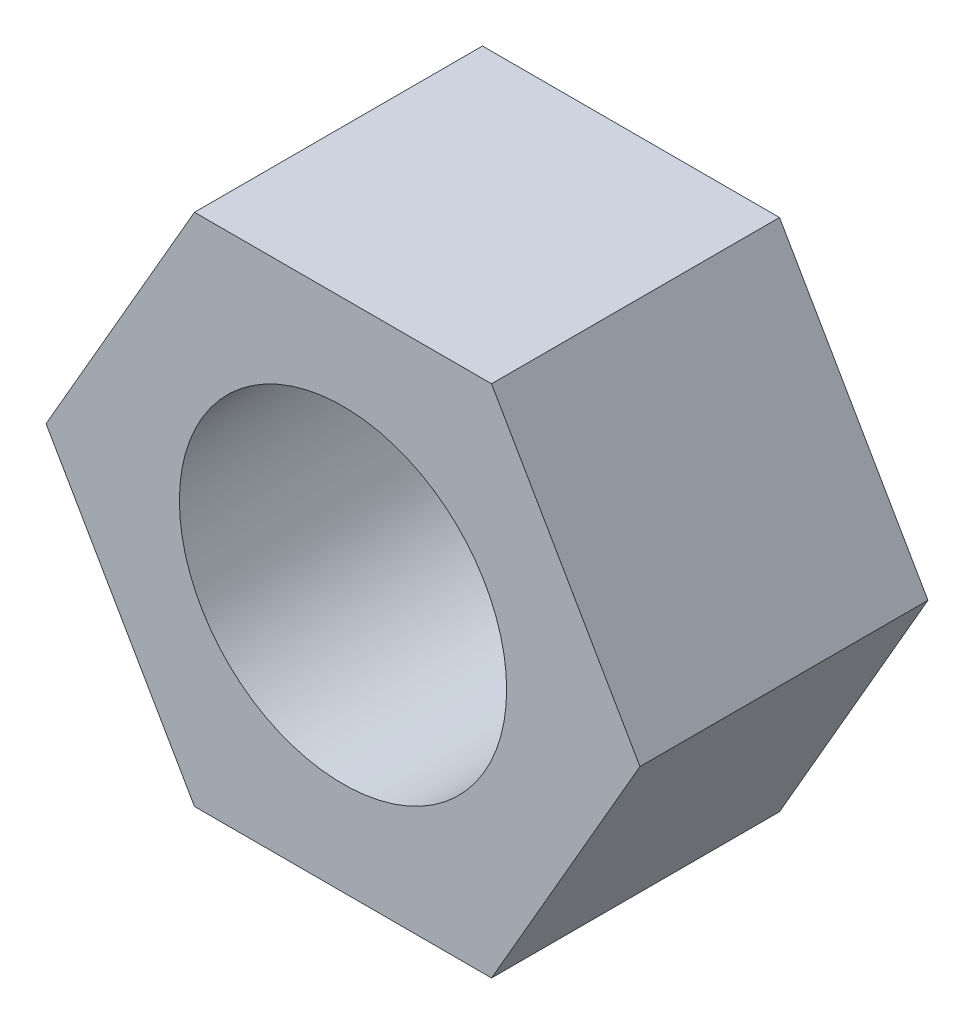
ISO-10303-21;
HEADER;
FILE_DESCRIPTION(('STEP AP214'),'2;1');
FILE_NAME('part.step','',(''),(''),'','','');
FILE_SCHEMA(('AUTOMOTIVE_DESIGN { 1 0 10303 214 1 1 1 1 }'));
ENDSEC;
DATA;
#1=APPLICATION_CONTEXT('core data for automotive mechanical design processes');
#2=APPLICATION_PROTOCOL_DEFINITION('international standard','automotive_design',2000,#1);
#3=PRODUCT_CONTEXT('',#1,'mechanical');
#4=PRODUCT('Part','Part','',(#3));
#5=PRODUCT_RELATED_PRODUCT_CATEGORY('part','',(#4));
#6=PRODUCT_DEFINITION_FORMATION('','',#4);
#7=PRODUCT_DEFINITION_CONTEXT('part definition',#1,'design');
#8=PRODUCT_DEFINITION('design','',#6,#7);
#9=PRODUCT_DEFINITION_SHAPE('','',#8);
#10=(LENGTH_UNIT() NAMED_UNIT(*) SI_UNIT(.MILLI.,.METRE.));
#11=(NAMED_UNIT(*) PLANE_ANGLE_UNIT() SI_UNIT($,.RADIAN.));
#12=(NAMED_UNIT(*) SI_UNIT($,.STERADIAN.) SOLID_ANGLE_UNIT());
#13=UNCERTAINTY_MEASURE_WITH_UNIT(LENGTH_MEASURE(1.E-05),#10,'distance_accuracy_value','');
#14=(GEOMETRIC_REPRESENTATION_CONTEXT(3) GLOBAL_UNCERTAINTY_ASSIGNED_CONTEXT((#13)) GLOBAL_UNIT_ASSIGNED_CONTEXT((#10,
#11,#12)) REPRESENTATION_CONTEXT('',''));
#15=CARTESIAN_POINT('',(0.,0.,0.));
#16=DIRECTION('',(0.,0.,1.));
#17=DIRECTION('',(1.,0.,0.));
#18=AXIS2_PLACEMENT_3D('',#15,#16,#17);
#19=CARTESIAN_POINT('',(5.04355371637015,-8.7376,9.779));
#20=DIRECTION('',(-0.866214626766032,0.499672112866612,0.));
#21=DIRECTION('',(-0.499672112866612,-0.866214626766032,0.));
#22=AXIS2_PLACEMENT_3D('',#19,#20,#21);
#23=PLANE('',#22);
#24=DIRECTION('',(0.499672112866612,0.866214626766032,0.));
#25=VECTOR('',#24,1.);
#26=CARTESIAN_POINT('',(5.04355371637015,-8.7376,0.));
#27=LINE('',#26,#25);
#28=CARTESIAN_POINT('',(5.04355371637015,-8.7376,0.));
#29=VERTEX_POINT('',#28);
#30=CARTESIAN_POINT('',(10.0838,0.,0.));
#31=VERTEX_POINT('',#30);
#32=EDGE_CURVE('E88',#29,#31,#27,.T.);
#33=ORIENTED_EDGE('',*,*,#32,.T.);
#34=DIRECTION('',(0.,0.,-1.));
#35=VECTOR('',#34,1.);
#36=CARTESIAN_POINT('',(10.0838,0.,9.779));
#37=LINE('',#36,#35);
#38=CARTESIAN_POINT('',(10.0838,0.,9.779));
#39=VERTEX_POINT('',#38);
#40=EDGE_CURVE('E11',#39,#31,#37,.T.);
#41=ORIENTED_EDGE('',*,*,#40,.F.);
#42=DIRECTION('',(0.499672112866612,0.866214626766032,0.));
#43=VECTOR('',#42,1.);
#44=CARTESIAN_POINT('',(5.04355371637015,-8.7376,9.779));
#45=LINE('',#44,#43);
#46=CARTESIAN_POINT('',(5.04355371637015,-8.7376,9.779));
#47=VERTEX_POINT('',#46);
#48=EDGE_CURVE('E116',#47,#39,#45,.T.);
#49=ORIENTED_EDGE('',*,*,#48,.F.);
#50=DIRECTION('',(0.,0.,-1.));
#51=VECTOR('',#50,1.);
#52=CARTESIAN_POINT('',(5.04355371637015,-8.7376,9.779));
#53=LINE('',#52,#51);
#54=EDGE_CURVE('E101',#47,#29,#53,.T.);
#55=ORIENTED_EDGE('',*,*,#54,.T.);
#56=EDGE_LOOP('',(#33,#41,#49,#55));
#57=FACE_BOUND('',#56,.T.);
#58=ADVANCED_FACE('F32',(#57),#23,.F.);
#59=CARTESIAN_POINT('',(5.04355371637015,8.7376,9.779));
#60=DIRECTION('',(-0.866214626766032,-0.499672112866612,0.));
#61=DIRECTION('',(0.499672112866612,-0.866214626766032,0.));
#62=AXIS2_PLACEMENT_3D('',#59,#60,#61);
#63=PLANE('',#62);
#64=DIRECTION('',(-0.499672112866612,0.866214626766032,0.));
#65=VECTOR('',#64,1.);
#66=CARTESIAN_POINT('',(5.04355371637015,8.7376,0.));
#67=LINE('',#66,#65);
#68=CARTESIAN_POINT('',(5.04355371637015,8.7376,0.));
#69=VERTEX_POINT('',#68);
#70=EDGE_CURVE('E84',#31,#69,#67,.T.);
#71=ORIENTED_EDGE('',*,*,#70,.T.);
#72=DIRECTION('',(0.,0.,-1.));
#73=VECTOR('',#72,1.);
#74=CARTESIAN_POINT('',(5.04355371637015,8.7376,9.779));
#75=LINE('',#74,#73);
#76=CARTESIAN_POINT('',(5.04355371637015,8.7376,9.779));
#77=VERTEX_POINT('',#76);
#78=EDGE_CURVE('E39',#77,#69,#75,.T.);
#79=ORIENTED_EDGE('',*,*,#78,.F.);
#80=DIRECTION('',(-0.499672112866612,0.866214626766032,0.));
#81=VECTOR('',#80,1.);
#82=CARTESIAN_POINT('',(5.04355371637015,8.7376,9.779));
#83=LINE('',#82,#81);
#84=EDGE_CURVE('E97',#39,#77,#83,.T.);
#85=ORIENTED_EDGE('',*,*,#84,.F.);
#86=ORIENTED_EDGE('',*,*,#40,.T.);
#87=EDGE_LOOP('',(#71,#79,#85,#86));
#88=FACE_BOUND('',#87,.T.);
#89=ADVANCED_FACE('F96',(#88),#63,.F.);
#90=CARTESIAN_POINT('',(5.04355371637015,8.7376,9.779));
#91=DIRECTION('',(0.,-1.,0.));
#92=DIRECTION('',(0.,0.,-1.));
#93=AXIS2_PLACEMENT_3D('',#90,#91,#92);
#94=PLANE('',#93);
#95=DIRECTION('',(-1.,0.,0.));
#96=VECTOR('',#95,1.);
#97=CARTESIAN_POINT('',(5.04355371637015,8.7376,0.));
#98=LINE('',#97,#96);
#99=CARTESIAN_POINT('',(-5.04355371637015,8.7376,0.));
#100=VERTEX_POINT('',#99);
#101=EDGE_CURVE('E90',#69,#100,#98,.T.);
#102=ORIENTED_EDGE('',*,*,#101,.T.);
#103=DIRECTION('',(0.,0.,-1.));
#104=VECTOR('',#103,1.);
#105=CARTESIAN_POINT('',(-5.04355371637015,8.7376,9.779));
#106=LINE('',#105,#104);
#107=CARTESIAN_POINT('',(-5.04355371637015,8.7376,9.779));
#108=VERTEX_POINT('',#107);
#109=EDGE_CURVE('E132',#108,#100,#106,.T.);
#110=ORIENTED_EDGE('',*,*,#109,.F.);
#111=DIRECTION('',(-1.,0.,0.));
#112=VECTOR('',#111,1.);
#113=CARTESIAN_POINT('',(5.04355371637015,8.7376,9.779));
#114=LINE('',#113,#112);
#115=EDGE_CURVE('E119',#77,#108,#114,.T.);
#116=ORIENTED_EDGE('',*,*,#115,.F.);
#117=ORIENTED_EDGE('',*,*,#78,.T.);
#118=EDGE_LOOP('',(#102,#110,#116,#117));
#119=FACE_BOUND('',#118,.T.);
#120=ADVANCED_FACE('F136',(#119),#94,.F.);
#121=CARTESIAN_POINT('',(-5.04355371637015,8.7376,9.779));
#122=DIRECTION('',(0.866214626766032,-0.499672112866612,0.));
#123=DIRECTION('',(0.499672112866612,0.866214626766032,0.));
#124=AXIS2_PLACEMENT_3D('',#121,#122,#123);
#125=PLANE('',#124);
#126=DIRECTION('',(-0.499672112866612,-0.866214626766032,0.));
#127=VECTOR('',#126,1.);
#128=CARTESIAN_POINT('',(-5.04355371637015,8.7376,0.));
#129=LINE('',#128,#127);
#130=CARTESIAN_POINT('',(-10.0838,0.,0.));
#131=VERTEX_POINT('',#130);
#132=EDGE_CURVE('E110',#100,#131,#129,.T.);
#133=ORIENTED_EDGE('',*,*,#132,.T.);
#134=DIRECTION('',(0.,0.,-1.));
#135=VECTOR('',#134,1.);
#136=CARTESIAN_POINT('',(-10.0838,0.,9.779));
#137=LINE('',#136,#135);
#138=CARTESIAN_POINT('',(-10.0838,0.,9.779));
#139=VERTEX_POINT('',#138);
#140=EDGE_CURVE('E129',#139,#131,#137,.T.);
#141=ORIENTED_EDGE('',*,*,#140,.F.);
#142=DIRECTION('',(-0.499672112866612,-0.866214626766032,0.));
#143=VECTOR('',#142,1.);
#144=CARTESIAN_POINT('',(-5.04355371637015,8.7376,9.779));
#145=LINE('',#144,#143);
#146=EDGE_CURVE('E121',#108,#139,#145,.T.);
#147=ORIENTED_EDGE('',*,*,#146,.F.);
#148=ORIENTED_EDGE('',*,*,#109,.T.);
#149=EDGE_LOOP('',(#133,#141,#147,#148));
#150=FACE_BOUND('',#149,.T.);
#151=ADVANCED_FACE('F142',(#150),#125,.F.);
#152=CARTESIAN_POINT('',(-5.04355371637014,-8.7376,9.779));
#153=DIRECTION('',(0.866214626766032,0.499672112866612,0.));
#154=DIRECTION('',(-0.499672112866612,0.866214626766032,0.));
#155=AXIS2_PLACEMENT_3D('',#152,#153,#154);
#156=PLANE('',#155);
#157=DIRECTION('',(0.499672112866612,-0.866214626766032,0.));
#158=VECTOR('',#157,1.);
#159=CARTESIAN_POINT('',(-5.04355371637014,-8.7376,0.));
#160=LINE('',#159,#158);
#161=CARTESIAN_POINT('',(-5.04355371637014,-8.7376,0.));
#162=VERTEX_POINT('',#161);
#163=EDGE_CURVE('E112',#131,#162,#160,.T.);
#164=ORIENTED_EDGE('',*,*,#163,.T.);
#165=DIRECTION('',(0.,0.,-1.));
#166=VECTOR('',#165,1.);
#167=CARTESIAN_POINT('',(-5.04355371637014,-8.7376,9.779));
#168=LINE('',#167,#166);
#169=CARTESIAN_POINT('',(-5.04355371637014,-8.7376,9.779));
#170=VERTEX_POINT('',#169);
#171=EDGE_CURVE('E126',#170,#162,#168,.T.);
#172=ORIENTED_EDGE('',*,*,#171,.F.);
#173=DIRECTION('',(0.499672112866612,-0.866214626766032,0.));
#174=VECTOR('',#173,1.);
#175=CARTESIAN_POINT('',(-5.04355371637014,-8.7376,9.779));
#176=LINE('',#175,#174);
#177=EDGE_CURVE('E51',#139,#170,#176,.T.);
#178=ORIENTED_EDGE('',*,*,#177,.F.);
#179=ORIENTED_EDGE('',*,*,#140,.T.);
#180=EDGE_LOOP('',(#164,#172,#178,#179));
#181=FACE_BOUND('',#180,.T.);
#182=ADVANCED_FACE('F145',(#181),#156,.F.);
#183=CARTESIAN_POINT('',(5.04355371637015,-8.7376,9.779));
#184=DIRECTION('',(0.,1.,0.));
#185=DIRECTION('',(-1.,0.,0.));
#186=AXIS2_PLACEMENT_3D('',#183,#184,#185);
#187=PLANE('',#186);
#188=DIRECTION('',(1.,0.,0.));
#189=VECTOR('',#188,1.);
#190=CARTESIAN_POINT('',(5.04355371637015,-8.7376,0.));
#191=LINE('',#190,#189);
#192=EDGE_CURVE('E114',#162,#29,#191,.T.);
#193=ORIENTED_EDGE('',*,*,#192,.T.);
#194=ORIENTED_EDGE('',*,*,#54,.F.);
#195=DIRECTION('',(1.,0.,0.));
#196=VECTOR('',#195,1.);
#197=CARTESIAN_POINT('',(5.04355371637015,-8.7376,9.779));
#198=LINE('',#197,#196);
#199=EDGE_CURVE('E46',#170,#47,#198,.T.);
#200=ORIENTED_EDGE('',*,*,#199,.F.);
#201=ORIENTED_EDGE('',*,*,#171,.T.);
#202=EDGE_LOOP('',(#193,#194,#200,#201));
#203=FACE_BOUND('',#202,.T.);
#204=ADVANCED_FACE('F147',(#203),#187,.F.);
#205=CARTESIAN_POINT('',(15.1240462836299,8.7376,9.779));
#206=DIRECTION('',(0.,0.,1.));
#207=DIRECTION('',(1.,0.,0.));
#208=AXIS2_PLACEMENT_3D('',#205,#206,#207);
#209=PLANE('',#208);
#210=CARTESIAN_POINT('',(0.,0.,9.779));
#211=DIRECTION('',(0.,0.,1.));
#212=DIRECTION('',(1.,0.,0.));
#213=AXIS2_PLACEMENT_3D('',#210,#211,#212);
#214=CIRCLE('',#213,5.55625);
#215=CARTESIAN_POINT('',(5.55625,0.,9.779));
#216=VERTEX_POINT('',#215);
#217=EDGE_CURVE('E105',#216,#216,#214,.T.);
#218=ORIENTED_EDGE('',*,*,#217,.F.);
#219=EDGE_LOOP('',(#218));
#220=FACE_BOUND('',#219,.T.);
#221=ORIENTED_EDGE('',*,*,#48,.T.);
#222=ORIENTED_EDGE('',*,*,#84,.T.);
#223=ORIENTED_EDGE('',*,*,#115,.T.);
#224=ORIENTED_EDGE('',*,*,#146,.T.);
#225=ORIENTED_EDGE('',*,*,#177,.T.);
#226=ORIENTED_EDGE('',*,*,#199,.T.);
#227=EDGE_LOOP('',(#221,#222,#223,#224,#225,#226));
#228=FACE_BOUND('',#227,.T.);
#229=ADVANCED_FACE('F139',(#220,#228),#209,.T.);
#230=CARTESIAN_POINT('',(15.1240462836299,8.7376,0.));
#231=DIRECTION('',(0.,0.,1.));
#232=DIRECTION('',(1.,0.,0.));
#233=AXIS2_PLACEMENT_3D('',#230,#231,#232);
#234=PLANE('',#233);
#235=CARTESIAN_POINT('',(0.,0.,0.));
#236=DIRECTION('',(0.,0.,1.));
#237=DIRECTION('',(1.,0.,0.));
#238=AXIS2_PLACEMENT_3D('',#235,#236,#237);
#239=CIRCLE('',#238,5.55625);
#240=CARTESIAN_POINT('',(5.55625,0.,0.));
#241=VERTEX_POINT('',#240);
#242=EDGE_CURVE('E102',#241,#241,#239,.T.);
#243=ORIENTED_EDGE('',*,*,#242,.T.);
#244=EDGE_LOOP('',(#243));
#245=FACE_BOUND('',#244,.T.);
#246=ORIENTED_EDGE('',*,*,#32,.F.);
#247=ORIENTED_EDGE('',*,*,#192,.F.);
#248=ORIENTED_EDGE('',*,*,#163,.F.);
#249=ORIENTED_EDGE('',*,*,#132,.F.);
#250=ORIENTED_EDGE('',*,*,#101,.F.);
#251=ORIENTED_EDGE('',*,*,#70,.F.);
#252=EDGE_LOOP('',(#246,#247,#248,#249,#250,#251));
#253=FACE_BOUND('',#252,.T.);
#254=ADVANCED_FACE('F85',(#245,#253),#234,.F.);
#255=CARTESIAN_POINT('',(0.,0.,0.));
#256=DIRECTION('',(0.,0.,1.));
#257=DIRECTION('',(1.,0.,0.));
#258=AXIS2_PLACEMENT_3D('',#255,#256,#257);
#259=CYLINDRICAL_SURFACE('',#258,5.55625);
#260=ORIENTED_EDGE('',*,*,#242,.F.);
#261=EDGE_LOOP('',(#260));
#262=FACE_BOUND('',#261,.T.);
#263=ORIENTED_EDGE('',*,*,#217,.T.);
#264=EDGE_LOOP('',(#263));
#265=FACE_BOUND('',#264,.T.);
#266=ADVANCED_FACE('F194',(#262,#265),#259,.F.);
#267=CLOSED_SHELL('',(#58,#89,#120,#151,#182,#204,#229,#254,#266));
#268=MANIFOLD_SOLID_BREP('B2',#267);
#269=ADVANCED_BREP_SHAPE_REPRESENTATION('',(#18,#268),#14);
#270=SHAPE_DEFINITION_REPRESENTATION(#9,#269);
ENDSEC;
END-ISO-10303-21;
